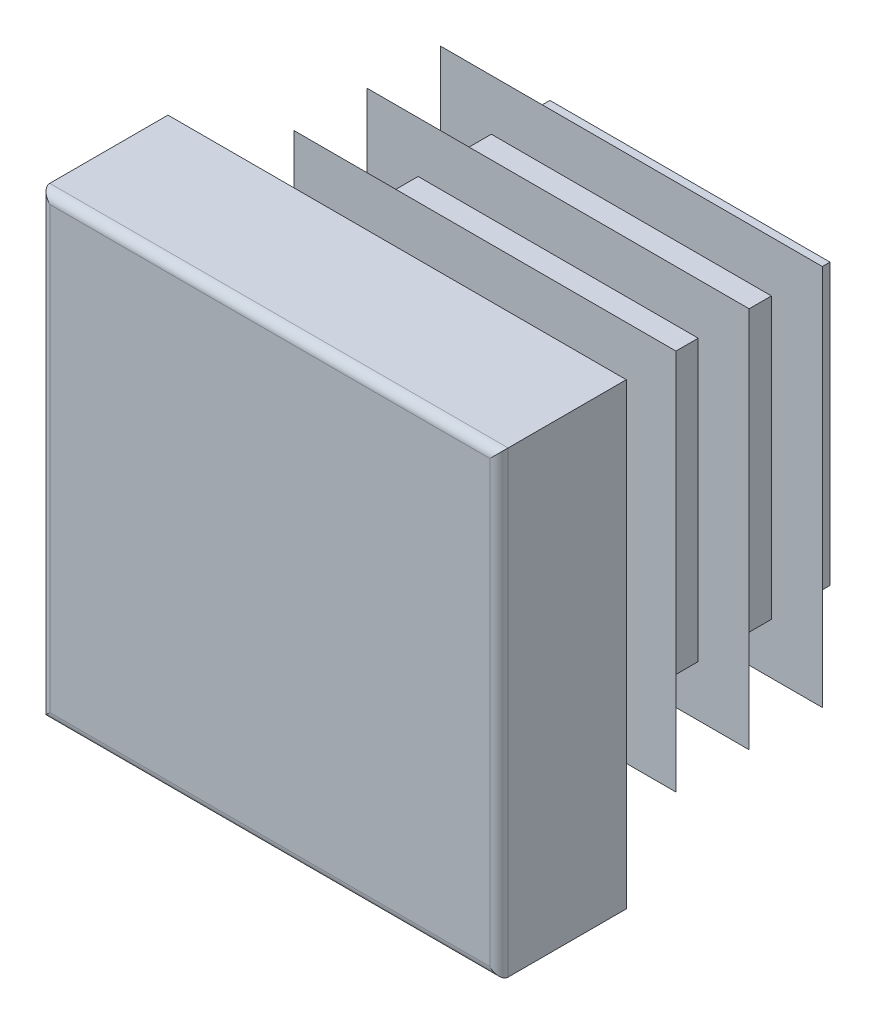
ISO-10303-21;
HEADER;
FILE_DESCRIPTION(('STEP AP214'),'2;1');
FILE_NAME('part.step','',(''),(''),'','','');
FILE_SCHEMA(('AUTOMOTIVE_DESIGN { 1 0 10303 214 1 1 1 1 }'));
ENDSEC;
DATA;
#1=APPLICATION_CONTEXT('core data for automotive mechanical design processes');
#2=APPLICATION_PROTOCOL_DEFINITION('international standard','automotive_design',2000,#1);
#3=PRODUCT_CONTEXT('',#1,'mechanical');
#4=PRODUCT('Part','Part','',(#3));
#5=PRODUCT_RELATED_PRODUCT_CATEGORY('part','',(#4));
#6=PRODUCT_DEFINITION_FORMATION('','',#4);
#7=PRODUCT_DEFINITION_CONTEXT('part definition',#1,'design');
#8=PRODUCT_DEFINITION('design','',#6,#7);
#9=PRODUCT_DEFINITION_SHAPE('','',#8);
#10=(LENGTH_UNIT() NAMED_UNIT(*) SI_UNIT(.MILLI.,.METRE.));
#11=(NAMED_UNIT(*) PLANE_ANGLE_UNIT() SI_UNIT($,.RADIAN.));
#12=(NAMED_UNIT(*) SI_UNIT($,.STERADIAN.) SOLID_ANGLE_UNIT());
#13=UNCERTAINTY_MEASURE_WITH_UNIT(LENGTH_MEASURE(1.E-05),#10,'distance_accuracy_value','');
#14=(GEOMETRIC_REPRESENTATION_CONTEXT(3) GLOBAL_UNCERTAINTY_ASSIGNED_CONTEXT((#13)) GLOBAL_UNIT_ASSIGNED_CONTEXT((#10,
#11,#12)) REPRESENTATION_CONTEXT('',''));
#15=CARTESIAN_POINT('',(0.,0.,0.));
#16=DIRECTION('',(0.,0.,1.));
#17=DIRECTION('',(1.,0.,0.));
#18=AXIS2_PLACEMENT_3D('',#15,#16,#17);
#19=CARTESIAN_POINT('',(8.64,-9.,5.));
#20=DIRECTION('',(0.,0.,-1.));
#21=DIRECTION('',(0.,1.,0.));
#22=AXIS2_PLACEMENT_3D('',#19,#20,#21);
#23=PLANE('',#22);
#24=DIRECTION('',(0.,1.,0.));
#25=VECTOR('',#24,1.);
#26=CARTESIAN_POINT('',(-8.64,-9.,5.));
#27=LINE('',#26,#25);
#28=CARTESIAN_POINT('',(-8.64,-8.64,5.));
#29=VERTEX_POINT('',#28);
#30=CARTESIAN_POINT('',(-8.64,8.64,5.));
#31=VERTEX_POINT('',#30);
#32=EDGE_CURVE('E262',#29,#31,#27,.T.);
#33=ORIENTED_EDGE('',*,*,#32,.F.);
#34=DIRECTION('',(-1.,0.,0.));
#35=VECTOR('',#34,1.);
#36=CARTESIAN_POINT('',(9.,-8.64,5.));
#37=LINE('',#36,#35);
#38=CARTESIAN_POINT('',(8.64,-8.64,5.));
#39=VERTEX_POINT('',#38);
#40=EDGE_CURVE('E432',#39,#29,#37,.T.);
#41=ORIENTED_EDGE('',*,*,#40,.F.);
#42=DIRECTION('',(0.,1.,0.));
#43=VECTOR('',#42,1.);
#44=CARTESIAN_POINT('',(8.64,-9.,5.));
#45=LINE('',#44,#43);
#46=CARTESIAN_POINT('',(8.64,8.64,5.));
#47=VERTEX_POINT('',#46);
#48=EDGE_CURVE('E257',#39,#47,#45,.T.);
#49=ORIENTED_EDGE('',*,*,#48,.T.);
#50=DIRECTION('',(-1.,0.,0.));
#51=VECTOR('',#50,1.);
#52=CARTESIAN_POINT('',(9.,8.64,5.));
#53=LINE('',#52,#51);
#54=EDGE_CURVE('E534',#47,#31,#53,.T.);
#55=ORIENTED_EDGE('',*,*,#54,.T.);
#56=EDGE_LOOP('',(#33,#41,#49,#55));
#57=FACE_BOUND('',#56,.T.);
#58=ADVANCED_FACE('F14',(#57),#23,.F.);
#59=CARTESIAN_POINT('',(-8.64,-9.,4.64));
#60=DIRECTION('',(0.,1.,0.));
#61=DIRECTION('',(-1.,0.,0.));
#62=AXIS2_PLACEMENT_3D('',#59,#60,#61);
#63=CYLINDRICAL_SURFACE('',#62,0.36);
#64=DIRECTION('',(0.,1.,0.));
#65=VECTOR('',#64,1.);
#66=CARTESIAN_POINT('',(-9.,-9.,4.64));
#67=LINE('',#66,#65);
#68=CARTESIAN_POINT('',(-9.,-9.,4.64));
#69=VERTEX_POINT('',#68);
#70=CARTESIAN_POINT('',(-9.,9.,4.64));
#71=VERTEX_POINT('',#70);
#72=EDGE_CURVE('E354',#69,#71,#67,.T.);
#73=ORIENTED_EDGE('',*,*,#72,.F.);
#74=CARTESIAN_POINT('',(-8.64,-8.64,4.64));
#75=DIRECTION('',(-0.707106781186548,0.707106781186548,0.));
#76=DIRECTION('',(0.707106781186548,0.707106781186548,0.));
#77=AXIS2_PLACEMENT_3D('',#74,#75,#76);
#78=ELLIPSE('',#77,0.509116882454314,0.36);
#79=EDGE_CURVE('E59',#69,#29,#78,.T.);
#80=ORIENTED_EDGE('',*,*,#79,.T.);
#81=ORIENTED_EDGE('',*,*,#32,.T.);
#82=CARTESIAN_POINT('',(-8.64,8.64,4.64));
#83=DIRECTION('',(0.707106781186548,0.707106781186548,0.));
#84=DIRECTION('',(-0.707106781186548,0.707106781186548,0.));
#85=AXIS2_PLACEMENT_3D('',#82,#83,#84);
#86=ELLIPSE('',#85,0.509116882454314,0.36);
#87=EDGE_CURVE('E258',#31,#71,#86,.F.);
#88=ORIENTED_EDGE('',*,*,#87,.T.);
#89=EDGE_LOOP('',(#73,#80,#81,#88));
#90=FACE_BOUND('',#89,.T.);
#91=ADVANCED_FACE('F16',(#90),#63,.T.);
#92=CARTESIAN_POINT('',(-9.,-9.,4.64));
#93=DIRECTION('',(1.,0.,0.));
#94=DIRECTION('',(0.,1.,0.));
#95=AXIS2_PLACEMENT_3D('',#92,#93,#94);
#96=PLANE('',#95);
#97=DIRECTION('',(0.,0.,-1.));
#98=VECTOR('',#97,1.);
#99=CARTESIAN_POINT('',(-9.,9.,4.64));
#100=LINE('',#99,#98);
#101=CARTESIAN_POINT('',(-9.,9.,0.));
#102=VERTEX_POINT('',#101);
#103=EDGE_CURVE('E519',#71,#102,#100,.T.);
#104=ORIENTED_EDGE('',*,*,#103,.T.);
#105=DIRECTION('',(0.,1.,0.));
#106=VECTOR('',#105,1.);
#107=CARTESIAN_POINT('',(-9.,-9.,0.));
#108=LINE('',#107,#106);
#109=CARTESIAN_POINT('',(-9.,-9.,0.));
#110=VERTEX_POINT('',#109);
#111=EDGE_CURVE('E352',#110,#102,#108,.T.);
#112=ORIENTED_EDGE('',*,*,#111,.F.);
#113=DIRECTION('',(0.,0.,-1.));
#114=VECTOR('',#113,1.);
#115=CARTESIAN_POINT('',(-9.,-9.,4.64));
#116=LINE('',#115,#114);
#117=EDGE_CURVE('E520',#69,#110,#116,.T.);
#118=ORIENTED_EDGE('',*,*,#117,.F.);
#119=ORIENTED_EDGE('',*,*,#72,.T.);
#120=EDGE_LOOP('',(#104,#112,#118,#119));
#121=FACE_BOUND('',#120,.T.);
#122=ADVANCED_FACE('F604',(#121),#96,.F.);
#123=CARTESIAN_POINT('',(-5.5,-9.,0.));
#124=DIRECTION('',(1.,0.,0.));
#125=DIRECTION('',(0.,1.,0.));
#126=AXIS2_PLACEMENT_3D('',#123,#124,#125);
#127=PLANE('',#126);
#128=DIRECTION('',(0.,1.,0.));
#129=VECTOR('',#128,1.);
#130=CARTESIAN_POINT('',(-5.5,-9.,0.));
#131=LINE('',#130,#129);
#132=CARTESIAN_POINT('',(-5.5,-5.5,0.));
#133=VERTEX_POINT('',#132);
#134=CARTESIAN_POINT('',(-5.5,5.5,0.));
#135=VERTEX_POINT('',#134);
#136=EDGE_CURVE('E349',#133,#135,#131,.T.);
#137=ORIENTED_EDGE('',*,*,#136,.T.);
#138=DIRECTION('',(0.,0.,-1.));
#139=VECTOR('',#138,1.);
#140=CARTESIAN_POINT('',(-5.5,5.5,0.));
#141=LINE('',#140,#139);
#142=CARTESIAN_POINT('',(-5.5,5.5,-0.575));
#143=VERTEX_POINT('',#142);
#144=EDGE_CURVE('E445',#135,#143,#141,.T.);
#145=ORIENTED_EDGE('',*,*,#144,.T.);
#146=DIRECTION('',(0.,1.,0.));
#147=VECTOR('',#146,1.);
#148=CARTESIAN_POINT('',(-5.5,-9.,-0.575));
#149=LINE('',#148,#147);
#150=CARTESIAN_POINT('',(-5.5,-5.5,-0.575));
#151=VERTEX_POINT('',#150);
#152=EDGE_CURVE('E346',#151,#143,#149,.T.);
#153=ORIENTED_EDGE('',*,*,#152,.F.);
#154=DIRECTION('',(0.,0.,1.));
#155=VECTOR('',#154,1.);
#156=CARTESIAN_POINT('',(-5.5,-5.5,0.));
#157=LINE('',#156,#155);
#158=EDGE_CURVE('E439',#151,#133,#157,.T.);
#159=ORIENTED_EDGE('',*,*,#158,.T.);
#160=EDGE_LOOP('',(#137,#145,#153,#159));
#161=FACE_BOUND('',#160,.T.);
#162=ADVANCED_FACE('F728',(#161),#127,.F.);
#163=CARTESIAN_POINT('',(-7.5,-9.,-0.575));
#164=DIRECTION('',(0.573576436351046,0.,0.819152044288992));
#165=DIRECTION('',(-0.819152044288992,0.,0.573576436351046));
#166=AXIS2_PLACEMENT_3D('',#163,#164,#165);
#167=PLANE('',#166);
#168=DIRECTION('',(0.,1.,0.));
#169=VECTOR('',#168,1.);
#170=CARTESIAN_POINT('',(-7.5,-9.,-0.575));
#171=LINE('',#170,#169);
#172=CARTESIAN_POINT('',(-7.5,-7.5,-0.575));
#173=VERTEX_POINT('',#172);
#174=CARTESIAN_POINT('',(-7.5,7.5,-0.575));
#175=VERTEX_POINT('',#174);
#176=EDGE_CURVE('E344',#173,#175,#171,.T.);
#177=ORIENTED_EDGE('',*,*,#176,.T.);
#178=DIRECTION('',(0.633687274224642,-0.633687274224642,-0.443712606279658));
#179=VECTOR('',#178,1.);
#180=CARTESIAN_POINT('',(-0.874267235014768,0.874267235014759,-5.21438802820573));
#181=LINE('',#180,#179);
#182=CARTESIAN_POINT('',(-5.5,5.5,-1.97541507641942));
#183=VERTEX_POINT('',#182);
#184=EDGE_CURVE('E457',#175,#183,#181,.T.);
#185=ORIENTED_EDGE('',*,*,#184,.T.);
#186=DIRECTION('',(0.,1.,0.));
#187=VECTOR('',#186,1.);
#188=CARTESIAN_POINT('',(-5.5,-9.,-1.97541507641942));
#189=LINE('',#188,#187);
#190=CARTESIAN_POINT('',(-5.5,-5.5,-1.97541507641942));
#191=VERTEX_POINT('',#190);
#192=EDGE_CURVE('E341',#191,#183,#189,.T.);
#193=ORIENTED_EDGE('',*,*,#192,.F.);
#194=DIRECTION('',(-0.633687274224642,-0.633687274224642,0.443712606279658));
#195=VECTOR('',#194,1.);
#196=CARTESIAN_POINT('',(-8.10233934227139,-8.10233934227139,-0.153237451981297));
#197=LINE('',#196,#195);
#198=EDGE_CURVE('E451',#191,#173,#197,.T.);
#199=ORIENTED_EDGE('',*,*,#198,.T.);
#200=EDGE_LOOP('',(#177,#185,#193,#199));
#201=FACE_BOUND('',#200,.T.);
#202=ADVANCED_FACE('F732',(#201),#167,.F.);
#203=CARTESIAN_POINT('',(-5.5,-9.,-1.97541507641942));
#204=DIRECTION('',(1.,0.,0.));
#205=DIRECTION('',(0.,1.,0.));
#206=AXIS2_PLACEMENT_3D('',#203,#204,#205);
#207=PLANE('',#206);
#208=ORIENTED_EDGE('',*,*,#192,.T.);
#209=DIRECTION('',(0.,0.,-1.));
#210=VECTOR('',#209,1.);
#211=CARTESIAN_POINT('',(-5.5,5.5,-1.97541507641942));
#212=LINE('',#211,#210);
#213=CARTESIAN_POINT('',(-5.5,5.5,-3.45));
#214=VERTEX_POINT('',#213);
#215=EDGE_CURVE('E463',#183,#214,#212,.T.);
#216=ORIENTED_EDGE('',*,*,#215,.T.);
#217=DIRECTION('',(0.,1.,0.));
#218=VECTOR('',#217,1.);
#219=CARTESIAN_POINT('',(-5.5,-9.,-3.45));
#220=LINE('',#219,#218);
#221=CARTESIAN_POINT('',(-5.5,-5.5,-3.45));
#222=VERTEX_POINT('',#221);
#223=EDGE_CURVE('E338',#222,#214,#220,.T.);
#224=ORIENTED_EDGE('',*,*,#223,.F.);
#225=DIRECTION('',(0.,0.,1.));
#226=VECTOR('',#225,1.);
#227=CARTESIAN_POINT('',(-5.5,-5.5,-1.97541507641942));
#228=LINE('',#227,#226);
#229=EDGE_CURVE('E460',#222,#191,#228,.T.);
#230=ORIENTED_EDGE('',*,*,#229,.T.);
#231=EDGE_LOOP('',(#208,#216,#224,#230));
#232=FACE_BOUND('',#231,.T.);
#233=ADVANCED_FACE('F738',(#232),#207,.F.);
#234=CARTESIAN_POINT('',(-7.5,-9.,-3.45));
#235=DIRECTION('',(0.573576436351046,0.,0.819152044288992));
#236=DIRECTION('',(-0.819152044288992,0.,0.573576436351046));
#237=AXIS2_PLACEMENT_3D('',#234,#235,#236);
#238=PLANE('',#237);
#239=DIRECTION('',(0.,1.,0.));
#240=VECTOR('',#239,1.);
#241=CARTESIAN_POINT('',(-7.5,-9.,-3.45));
#242=LINE('',#241,#240);
#243=CARTESIAN_POINT('',(-7.5,-7.5,-3.45));
#244=VERTEX_POINT('',#243);
#245=CARTESIAN_POINT('',(-7.5,7.5,-3.45));
#246=VERTEX_POINT('',#245);
#247=EDGE_CURVE('E336',#244,#246,#242,.T.);
#248=ORIENTED_EDGE('',*,*,#247,.T.);
#249=DIRECTION('',(0.633687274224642,-0.633687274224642,-0.443712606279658));
#250=VECTOR('',#249,1.);
#251=CARTESIAN_POINT('',(-0.874267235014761,0.874267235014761,-8.08938802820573));
#252=LINE('',#251,#250);
#253=CARTESIAN_POINT('',(-5.5,5.5,-4.85041507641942));
#254=VERTEX_POINT('',#253);
#255=EDGE_CURVE('E475',#246,#254,#252,.T.);
#256=ORIENTED_EDGE('',*,*,#255,.T.);
#257=DIRECTION('',(0.,1.,0.));
#258=VECTOR('',#257,1.);
#259=CARTESIAN_POINT('',(-5.5,-9.,-4.85041507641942));
#260=LINE('',#259,#258);
#261=CARTESIAN_POINT('',(-5.5,-5.5,-4.85041507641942));
#262=VERTEX_POINT('',#261);
#263=EDGE_CURVE('E333',#262,#254,#260,.T.);
#264=ORIENTED_EDGE('',*,*,#263,.F.);
#265=DIRECTION('',(-0.633687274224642,-0.633687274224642,0.443712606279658));
#266=VECTOR('',#265,1.);
#267=CARTESIAN_POINT('',(-8.10233934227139,-8.10233934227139,-3.02823745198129));
#268=LINE('',#267,#266);
#269=EDGE_CURVE('E469',#262,#244,#268,.T.);
#270=ORIENTED_EDGE('',*,*,#269,.T.);
#271=EDGE_LOOP('',(#248,#256,#264,#270));
#272=FACE_BOUND('',#271,.T.);
#273=ADVANCED_FACE('F742',(#272),#238,.F.);
#274=CARTESIAN_POINT('',(-5.5,-9.,-4.85041507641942));
#275=DIRECTION('',(1.,0.,0.));
#276=DIRECTION('',(0.,1.,0.));
#277=AXIS2_PLACEMENT_3D('',#274,#275,#276);
#278=PLANE('',#277);
#279=ORIENTED_EDGE('',*,*,#263,.T.);
#280=DIRECTION('',(0.,0.,-1.));
#281=VECTOR('',#280,1.);
#282=CARTESIAN_POINT('',(-5.5,5.5,-4.85041507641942));
#283=LINE('',#282,#281);
#284=CARTESIAN_POINT('',(-5.5,5.5,-6.325));
#285=VERTEX_POINT('',#284);
#286=EDGE_CURVE('E481',#254,#285,#283,.T.);
#287=ORIENTED_EDGE('',*,*,#286,.T.);
#288=DIRECTION('',(0.,1.,0.));
#289=VECTOR('',#288,1.);
#290=CARTESIAN_POINT('',(-5.5,-9.,-6.325));
#291=LINE('',#290,#289);
#292=CARTESIAN_POINT('',(-5.5,-5.5,-6.325));
#293=VERTEX_POINT('',#292);
#294=EDGE_CURVE('E330',#293,#285,#291,.T.);
#295=ORIENTED_EDGE('',*,*,#294,.F.);
#296=DIRECTION('',(0.,0.,1.));
#297=VECTOR('',#296,1.);
#298=CARTESIAN_POINT('',(-5.5,-5.5,-4.85041507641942));
#299=LINE('',#298,#297);
#300=EDGE_CURVE('E478',#293,#262,#299,.T.);
#301=ORIENTED_EDGE('',*,*,#300,.T.);
#302=EDGE_LOOP('',(#279,#287,#295,#301));
#303=FACE_BOUND('',#302,.T.);
#304=ADVANCED_FACE('F746',(#303),#278,.F.);
#305=CARTESIAN_POINT('',(-7.5,-9.,-6.325));
#306=DIRECTION('',(0.573576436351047,0.,0.819152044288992));
#307=DIRECTION('',(-0.819152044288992,0.,0.573576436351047));
#308=AXIS2_PLACEMENT_3D('',#305,#306,#307);
#309=PLANE('',#308);
#310=DIRECTION('',(0.,1.,0.));
#311=VECTOR('',#310,1.);
#312=CARTESIAN_POINT('',(-7.5,-9.,-6.325));
#313=LINE('',#312,#311);
#314=CARTESIAN_POINT('',(-7.5,-7.5,-6.325));
#315=VERTEX_POINT('',#314);
#316=CARTESIAN_POINT('',(-7.5,7.5,-6.325));
#317=VERTEX_POINT('',#316);
#318=EDGE_CURVE('E328',#315,#317,#313,.T.);
#319=ORIENTED_EDGE('',*,*,#318,.T.);
#320=DIRECTION('',(0.633687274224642,-0.633687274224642,-0.443712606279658));
#321=VECTOR('',#320,1.);
#322=CARTESIAN_POINT('',(-0.874267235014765,0.874267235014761,-10.9643880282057));
#323=LINE('',#322,#321);
#324=CARTESIAN_POINT('',(-5.5,5.5,-7.72541507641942));
#325=VERTEX_POINT('',#324);
#326=EDGE_CURVE('E493',#317,#325,#323,.T.);
#327=ORIENTED_EDGE('',*,*,#326,.T.);
#328=DIRECTION('',(0.,1.,0.));
#329=VECTOR('',#328,1.);
#330=CARTESIAN_POINT('',(-5.5,-9.,-7.72541507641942));
#331=LINE('',#330,#329);
#332=CARTESIAN_POINT('',(-5.5,-5.5,-7.72541507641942));
#333=VERTEX_POINT('',#332);
#334=EDGE_CURVE('E325',#333,#325,#331,.T.);
#335=ORIENTED_EDGE('',*,*,#334,.F.);
#336=DIRECTION('',(-0.633687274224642,-0.633687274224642,0.443712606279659));
#337=VECTOR('',#336,1.);
#338=CARTESIAN_POINT('',(-8.10233934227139,-8.10233934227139,-5.9032374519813));
#339=LINE('',#338,#337);
#340=EDGE_CURVE('E487',#333,#315,#339,.T.);
#341=ORIENTED_EDGE('',*,*,#340,.T.);
#342=EDGE_LOOP('',(#319,#327,#335,#341));
#343=FACE_BOUND('',#342,.T.);
#344=ADVANCED_FACE('F668',(#343),#309,.F.);
#345=CARTESIAN_POINT('',(-5.5,-9.,-7.72541507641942));
#346=DIRECTION('',(1.,0.,0.));
#347=DIRECTION('',(0.,1.,0.));
#348=AXIS2_PLACEMENT_3D('',#345,#346,#347);
#349=PLANE('',#348);
#350=ORIENTED_EDGE('',*,*,#334,.T.);
#351=DIRECTION('',(0.,0.,-1.));
#352=VECTOR('',#351,1.);
#353=CARTESIAN_POINT('',(-5.5,5.5,-7.72541507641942));
#354=LINE('',#353,#352);
#355=CARTESIAN_POINT('',(-5.5,5.5,-9.2));
#356=VERTEX_POINT('',#355);
#357=EDGE_CURVE('E499',#325,#356,#354,.T.);
#358=ORIENTED_EDGE('',*,*,#357,.T.);
#359=DIRECTION('',(0.,1.,0.));
#360=VECTOR('',#359,1.);
#361=CARTESIAN_POINT('',(-5.5,-9.,-9.2));
#362=LINE('',#361,#360);
#363=CARTESIAN_POINT('',(-5.5,-5.5,-9.2));
#364=VERTEX_POINT('',#363);
#365=EDGE_CURVE('E322',#364,#356,#362,.T.);
#366=ORIENTED_EDGE('',*,*,#365,.F.);
#367=DIRECTION('',(0.,0.,1.));
#368=VECTOR('',#367,1.);
#369=CARTESIAN_POINT('',(-5.5,-5.5,-7.72541507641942));
#370=LINE('',#369,#368);
#371=EDGE_CURVE('E496',#364,#333,#370,.T.);
#372=ORIENTED_EDGE('',*,*,#371,.T.);
#373=EDGE_LOOP('',(#350,#358,#366,#372));
#374=FACE_BOUND('',#373,.T.);
#375=ADVANCED_FACE('F665',(#374),#349,.F.);
#376=CARTESIAN_POINT('',(-7.5,-9.,-9.2));
#377=DIRECTION('',(0.573576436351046,0.,0.819152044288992));
#378=DIRECTION('',(-0.819152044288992,0.,0.573576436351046));
#379=AXIS2_PLACEMENT_3D('',#376,#377,#378);
#380=PLANE('',#379);
#381=DIRECTION('',(0.,1.,0.));
#382=VECTOR('',#381,1.);
#383=CARTESIAN_POINT('',(-7.5,-9.,-9.2));
#384=LINE('',#383,#382);
#385=CARTESIAN_POINT('',(-7.5,-7.5,-9.2));
#386=VERTEX_POINT('',#385);
#387=CARTESIAN_POINT('',(-7.5,7.5,-9.2));
#388=VERTEX_POINT('',#387);
#389=EDGE_CURVE('E320',#386,#388,#384,.T.);
#390=ORIENTED_EDGE('',*,*,#389,.T.);
#391=DIRECTION('',(0.633687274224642,-0.633687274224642,-0.443712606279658));
#392=VECTOR('',#391,1.);
#393=CARTESIAN_POINT('',(-0.874267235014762,0.874267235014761,-13.8393880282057));
#394=LINE('',#393,#392);
#395=CARTESIAN_POINT('',(-5.5,5.5,-10.6004150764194));
#396=VERTEX_POINT('',#395);
#397=EDGE_CURVE('E511',#388,#396,#394,.T.);
#398=ORIENTED_EDGE('',*,*,#397,.T.);
#399=DIRECTION('',(0.,1.,0.));
#400=VECTOR('',#399,1.);
#401=CARTESIAN_POINT('',(-5.5,-9.,-10.6004150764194));
#402=LINE('',#401,#400);
#403=CARTESIAN_POINT('',(-5.5,-5.5,-10.6004150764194));
#404=VERTEX_POINT('',#403);
#405=EDGE_CURVE('E317',#404,#396,#402,.T.);
#406=ORIENTED_EDGE('',*,*,#405,.F.);
#407=DIRECTION('',(-0.633687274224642,-0.633687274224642,0.443712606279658));
#408=VECTOR('',#407,1.);
#409=CARTESIAN_POINT('',(-8.10233934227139,-8.10233934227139,-8.7782374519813));
#410=LINE('',#409,#408);
#411=EDGE_CURVE('E505',#404,#386,#410,.T.);
#412=ORIENTED_EDGE('',*,*,#411,.T.);
#413=EDGE_LOOP('',(#390,#398,#406,#412));
#414=FACE_BOUND('',#413,.T.);
#415=ADVANCED_FACE('F580',(#414),#380,.F.);
#416=CARTESIAN_POINT('',(-5.5,-9.,-10.6004150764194));
#417=DIRECTION('',(1.,0.,0.));
#418=DIRECTION('',(0.,0.,1.));
#419=AXIS2_PLACEMENT_3D('',#416,#417,#418);
#420=PLANE('',#419);
#421=ORIENTED_EDGE('',*,*,#405,.T.);
#422=DIRECTION('',(0.,0.,-1.));
#423=VECTOR('',#422,1.);
#424=CARTESIAN_POINT('',(-5.5,5.5,-10.6004150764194));
#425=LINE('',#424,#423);
#426=CARTESIAN_POINT('',(-5.5,5.5,-11.5));
#427=VERTEX_POINT('',#426);
#428=EDGE_CURVE('E517',#396,#427,#425,.T.);
#429=ORIENTED_EDGE('',*,*,#428,.T.);
#430=DIRECTION('',(0.,1.,0.));
#431=VECTOR('',#430,1.);
#432=CARTESIAN_POINT('',(-5.5,-9.,-11.5));
#433=LINE('',#432,#431);
#434=CARTESIAN_POINT('',(-5.5,-5.5,-11.5));
#435=VERTEX_POINT('',#434);
#436=EDGE_CURVE('E314',#435,#427,#433,.T.);
#437=ORIENTED_EDGE('',*,*,#436,.F.);
#438=DIRECTION('',(0.,0.,1.));
#439=VECTOR('',#438,1.);
#440=CARTESIAN_POINT('',(-5.5,-5.5,-10.6004150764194));
#441=LINE('',#440,#439);
#442=EDGE_CURVE('E514',#435,#404,#441,.T.);
#443=ORIENTED_EDGE('',*,*,#442,.T.);
#444=EDGE_LOOP('',(#421,#429,#437,#443));
#445=FACE_BOUND('',#444,.T.);
#446=ADVANCED_FACE('F582',(#445),#420,.F.);
#447=CARTESIAN_POINT('',(-5.5,-9.,-11.5));
#448=DIRECTION('',(0.,0.,1.));
#449=DIRECTION('',(0.,-1.,0.));
#450=AXIS2_PLACEMENT_3D('',#447,#448,#449);
#451=PLANE('',#450);
#452=ORIENTED_EDGE('',*,*,#436,.T.);
#453=DIRECTION('',(-1.,0.,0.));
#454=VECTOR('',#453,1.);
#455=CARTESIAN_POINT('',(9.,5.5,-11.5));
#456=LINE('',#455,#454);
#457=CARTESIAN_POINT('',(5.5,5.5,-11.5));
#458=VERTEX_POINT('',#457);
#459=EDGE_CURVE('E388',#458,#427,#456,.T.);
#460=ORIENTED_EDGE('',*,*,#459,.F.);
#461=DIRECTION('',(0.,1.,0.));
#462=VECTOR('',#461,1.);
#463=CARTESIAN_POINT('',(5.5,-9.,-11.5));
#464=LINE('',#463,#462);
#465=CARTESIAN_POINT('',(5.5,-5.5,-11.5));
#466=VERTEX_POINT('',#465);
#467=EDGE_CURVE('E311',#466,#458,#464,.T.);
#468=ORIENTED_EDGE('',*,*,#467,.F.);
#469=DIRECTION('',(-1.,0.,0.));
#470=VECTOR('',#469,1.);
#471=CARTESIAN_POINT('',(9.,-5.5,-11.5));
#472=LINE('',#471,#470);
#473=EDGE_CURVE('E386',#466,#435,#472,.T.);
#474=ORIENTED_EDGE('',*,*,#473,.T.);
#475=EDGE_LOOP('',(#452,#460,#468,#474));
#476=FACE_BOUND('',#475,.T.);
#477=ADVANCED_FACE('F385',(#476),#451,.F.);
#478=CARTESIAN_POINT('',(5.5,-9.,-11.5));
#479=DIRECTION('',(-1.,0.,0.));
#480=DIRECTION('',(0.,0.,-1.));
#481=AXIS2_PLACEMENT_3D('',#478,#479,#480);
#482=PLANE('',#481);
#483=ORIENTED_EDGE('',*,*,#467,.T.);
#484=DIRECTION('',(0.,0.,1.));
#485=VECTOR('',#484,1.);
#486=CARTESIAN_POINT('',(5.5,5.5,-11.5));
#487=LINE('',#486,#485);
#488=CARTESIAN_POINT('',(5.5,5.5,-10.6004150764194));
#489=VERTEX_POINT('',#488);
#490=EDGE_CURVE('E9',#458,#489,#487,.T.);
#491=ORIENTED_EDGE('',*,*,#490,.T.);
#492=DIRECTION('',(0.,1.,0.));
#493=VECTOR('',#492,1.);
#494=CARTESIAN_POINT('',(5.5,-9.,-10.6004150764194));
#495=LINE('',#494,#493);
#496=CARTESIAN_POINT('',(5.5,-5.5,-10.6004150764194));
#497=VERTEX_POINT('',#496);
#498=EDGE_CURVE('E308',#497,#489,#495,.T.);
#499=ORIENTED_EDGE('',*,*,#498,.F.);
#500=DIRECTION('',(0.,0.,-1.));
#501=VECTOR('',#500,1.);
#502=CARTESIAN_POINT('',(5.5,-5.5,-11.5));
#503=LINE('',#502,#501);
#504=EDGE_CURVE('E23',#497,#466,#503,.T.);
#505=ORIENTED_EDGE('',*,*,#504,.T.);
#506=EDGE_LOOP('',(#483,#491,#499,#505));
#507=FACE_BOUND('',#506,.T.);
#508=ADVANCED_FACE('F378',(#507),#482,.F.);
#509=CARTESIAN_POINT('',(5.5,-9.,-10.6004150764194));
#510=DIRECTION('',(-0.573576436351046,0.,0.819152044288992));
#511=DIRECTION('',(-0.819152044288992,0.,-0.573576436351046));
#512=AXIS2_PLACEMENT_3D('',#509,#510,#511);
#513=PLANE('',#512);
#514=ORIENTED_EDGE('',*,*,#498,.T.);
#515=DIRECTION('',(0.633687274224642,0.633687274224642,0.443712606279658));
#516=VECTOR('',#515,1.);
#517=CARTESIAN_POINT('',(-0.322613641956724,-0.322613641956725,-14.6774530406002));
#518=LINE('',#517,#516);
#519=CARTESIAN_POINT('',(7.5,7.5,-9.2));
#520=VERTEX_POINT('',#519);
#521=EDGE_CURVE('E508',#489,#520,#518,.T.);
#522=ORIENTED_EDGE('',*,*,#521,.T.);
#523=DIRECTION('',(0.,1.,0.));
#524=VECTOR('',#523,1.);
#525=CARTESIAN_POINT('',(7.5,-9.,-9.2));
#526=LINE('',#525,#524);
#527=CARTESIAN_POINT('',(7.5,-7.5,-9.2));
#528=VERTEX_POINT('',#527);
#529=EDGE_CURVE('E305',#528,#520,#526,.T.);
#530=ORIENTED_EDGE('',*,*,#529,.F.);
#531=DIRECTION('',(-0.633687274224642,0.633687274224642,-0.443712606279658));
#532=VECTOR('',#531,1.);
#533=CARTESIAN_POINT('',(6.9054584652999,-6.9054584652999,-9.61630246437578));
#534=LINE('',#533,#532);
#535=EDGE_CURVE('E502',#528,#497,#534,.T.);
#536=ORIENTED_EDGE('',*,*,#535,.T.);
#537=EDGE_LOOP('',(#514,#522,#530,#536));
#538=FACE_BOUND('',#537,.T.);
#539=ADVANCED_FACE('F588',(#538),#513,.F.);
#540=CARTESIAN_POINT('',(7.5,-9.,-9.2));
#541=DIRECTION('',(0.,0.,-1.));
#542=DIRECTION('',(0.,1.,0.));
#543=AXIS2_PLACEMENT_3D('',#540,#541,#542);
#544=PLANE('',#543);
#545=ORIENTED_EDGE('',*,*,#529,.T.);
#546=DIRECTION('',(-1.,0.,0.));
#547=VECTOR('',#546,1.);
#548=CARTESIAN_POINT('',(9.,7.5,-9.2));
#549=LINE('',#548,#547);
#550=EDGE_CURVE('E394',#520,#388,#549,.T.);
#551=ORIENTED_EDGE('',*,*,#550,.T.);
#552=ORIENTED_EDGE('',*,*,#389,.F.);
#553=DIRECTION('',(-1.,0.,0.));
#554=VECTOR('',#553,1.);
#555=CARTESIAN_POINT('',(9.,-7.5,-9.2));
#556=LINE('',#555,#554);
#557=EDGE_CURVE('E401',#528,#386,#556,.T.);
#558=ORIENTED_EDGE('',*,*,#557,.F.);
#559=EDGE_LOOP('',(#545,#551,#552,#558));
#560=FACE_BOUND('',#559,.T.);
#561=ORIENTED_EDGE('',*,*,#365,.T.);
#562=DIRECTION('',(-1.,0.,0.));
#563=VECTOR('',#562,1.);
#564=CARTESIAN_POINT('',(9.,5.5,-9.2));
#565=LINE('',#564,#563);
#566=CARTESIAN_POINT('',(5.5,5.5,-9.2));
#567=VERTEX_POINT('',#566);
#568=EDGE_CURVE('E567',#567,#356,#565,.T.);
#569=ORIENTED_EDGE('',*,*,#568,.F.);
#570=DIRECTION('',(0.,1.,0.));
#571=VECTOR('',#570,1.);
#572=CARTESIAN_POINT('',(5.5,-9.,-9.2));
#573=LINE('',#572,#571);
#574=CARTESIAN_POINT('',(5.5,-5.5,-9.2));
#575=VERTEX_POINT('',#574);
#576=EDGE_CURVE('E302',#575,#567,#573,.T.);
#577=ORIENTED_EDGE('',*,*,#576,.F.);
#578=DIRECTION('',(-1.,0.,0.));
#579=VECTOR('',#578,1.);
#580=CARTESIAN_POINT('',(9.,-5.5,-9.2));
#581=LINE('',#580,#579);
#582=EDGE_CURVE('E403',#575,#364,#581,.T.);
#583=ORIENTED_EDGE('',*,*,#582,.T.);
#584=EDGE_LOOP('',(#561,#569,#577,#583));
#585=FACE_BOUND('',#584,.T.);
#586=ADVANCED_FACE('F571',(#560,#585),#544,.F.);
#587=CARTESIAN_POINT('',(5.5,-9.,-9.2));
#588=DIRECTION('',(-1.,0.,0.));
#589=DIRECTION('',(0.,-1.,0.));
#590=AXIS2_PLACEMENT_3D('',#587,#588,#589);
#591=PLANE('',#590);
#592=ORIENTED_EDGE('',*,*,#576,.T.);
#593=DIRECTION('',(0.,0.,1.));
#594=VECTOR('',#593,1.);
#595=CARTESIAN_POINT('',(5.5,5.5,-9.2));
#596=LINE('',#595,#594);
#597=CARTESIAN_POINT('',(5.5,5.5,-7.72541507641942));
#598=VERTEX_POINT('',#597);
#599=EDGE_CURVE('E372',#567,#598,#596,.T.);
#600=ORIENTED_EDGE('',*,*,#599,.T.);
#601=DIRECTION('',(0.,1.,0.));
#602=VECTOR('',#601,1.);
#603=CARTESIAN_POINT('',(5.5,-9.,-7.72541507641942));
#604=LINE('',#603,#602);
#605=CARTESIAN_POINT('',(5.5,-5.5,-7.72541507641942));
#606=VERTEX_POINT('',#605);
#607=EDGE_CURVE('E299',#606,#598,#604,.T.);
#608=ORIENTED_EDGE('',*,*,#607,.F.);
#609=DIRECTION('',(0.,0.,-1.));
#610=VECTOR('',#609,1.);
#611=CARTESIAN_POINT('',(5.5,-5.5,-9.2));
#612=LINE('',#611,#610);
#613=EDGE_CURVE('E369',#606,#575,#612,.T.);
#614=ORIENTED_EDGE('',*,*,#613,.T.);
#615=EDGE_LOOP('',(#592,#600,#608,#614));
#616=FACE_BOUND('',#615,.T.);
#617=ADVANCED_FACE('F596',(#616),#591,.F.);
#618=CARTESIAN_POINT('',(5.5,-9.,-7.72541507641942));
#619=DIRECTION('',(-0.573576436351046,0.,0.819152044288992));
#620=DIRECTION('',(-0.819152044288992,0.,-0.573576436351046));
#621=AXIS2_PLACEMENT_3D('',#618,#619,#620);
#622=PLANE('',#621);
#623=ORIENTED_EDGE('',*,*,#607,.T.);
#624=DIRECTION('',(0.633687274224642,0.633687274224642,0.443712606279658));
#625=VECTOR('',#624,1.);
#626=CARTESIAN_POINT('',(-0.322613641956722,-0.322613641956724,-11.8024530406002));
#627=LINE('',#626,#625);
#628=CARTESIAN_POINT('',(7.5,7.5,-6.325));
#629=VERTEX_POINT('',#628);
#630=EDGE_CURVE('E490',#598,#629,#627,.T.);
#631=ORIENTED_EDGE('',*,*,#630,.T.);
#632=DIRECTION('',(0.,1.,0.));
#633=VECTOR('',#632,1.);
#634=CARTESIAN_POINT('',(7.5,-9.,-6.325));
#635=LINE('',#634,#633);
#636=CARTESIAN_POINT('',(7.5,-7.5,-6.325));
#637=VERTEX_POINT('',#636);
#638=EDGE_CURVE('E296',#637,#629,#635,.T.);
#639=ORIENTED_EDGE('',*,*,#638,.F.);
#640=DIRECTION('',(-0.633687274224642,0.633687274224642,-0.443712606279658));
#641=VECTOR('',#640,1.);
#642=CARTESIAN_POINT('',(6.9054584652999,-6.9054584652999,-6.74130246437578));
#643=LINE('',#642,#641);
#644=EDGE_CURVE('E484',#637,#606,#643,.T.);
#645=ORIENTED_EDGE('',*,*,#644,.T.);
#646=EDGE_LOOP('',(#623,#631,#639,#645));
#647=FACE_BOUND('',#646,.T.);
#648=ADVANCED_FACE('F648',(#647),#622,.F.);
#649=CARTESIAN_POINT('',(7.5,-9.,-6.325));
#650=DIRECTION('',(0.,0.,-1.));
#651=DIRECTION('',(0.,1.,0.));
#652=AXIS2_PLACEMENT_3D('',#649,#650,#651);
#653=PLANE('',#652);
#654=ORIENTED_EDGE('',*,*,#638,.T.);
#655=DIRECTION('',(-1.,0.,0.));
#656=VECTOR('',#655,1.);
#657=CARTESIAN_POINT('',(9.,7.5,-6.325));
#658=LINE('',#657,#656);
#659=EDGE_CURVE('E561',#629,#317,#658,.T.);
#660=ORIENTED_EDGE('',*,*,#659,.T.);
#661=ORIENTED_EDGE('',*,*,#318,.F.);
#662=DIRECTION('',(-1.,0.,0.));
#663=VECTOR('',#662,1.);
#664=CARTESIAN_POINT('',(9.,-7.5,-6.325));
#665=LINE('',#664,#663);
#666=EDGE_CURVE('E409',#637,#315,#665,.T.);
#667=ORIENTED_EDGE('',*,*,#666,.F.);
#668=EDGE_LOOP('',(#654,#660,#661,#667));
#669=FACE_BOUND('',#668,.T.);
#670=ORIENTED_EDGE('',*,*,#294,.T.);
#671=DIRECTION('',(-1.,0.,0.));
#672=VECTOR('',#671,1.);
#673=CARTESIAN_POINT('',(9.,5.5,-6.325));
#674=LINE('',#673,#672);
#675=CARTESIAN_POINT('',(5.5,5.5,-6.325));
#676=VERTEX_POINT('',#675);
#677=EDGE_CURVE('E559',#676,#285,#674,.T.);
#678=ORIENTED_EDGE('',*,*,#677,.F.);
#679=DIRECTION('',(0.,1.,0.));
#680=VECTOR('',#679,1.);
#681=CARTESIAN_POINT('',(5.5,-9.,-6.325));
#682=LINE('',#681,#680);
#683=CARTESIAN_POINT('',(5.5,-5.5,-6.325));
#684=VERTEX_POINT('',#683);
#685=EDGE_CURVE('E293',#684,#676,#682,.T.);
#686=ORIENTED_EDGE('',*,*,#685,.F.);
#687=DIRECTION('',(-1.,0.,0.));
#688=VECTOR('',#687,1.);
#689=CARTESIAN_POINT('',(9.,-5.5,-6.325));
#690=LINE('',#689,#688);
#691=EDGE_CURVE('E411',#684,#293,#690,.T.);
#692=ORIENTED_EDGE('',*,*,#691,.T.);
#693=EDGE_LOOP('',(#670,#678,#686,#692));
#694=FACE_BOUND('',#693,.T.);
#695=ADVANCED_FACE('F644',(#669,#694),#653,.F.);
#696=CARTESIAN_POINT('',(5.5,-9.,-6.325));
#697=DIRECTION('',(-1.,0.,0.));
#698=DIRECTION('',(0.,-1.,0.));
#699=AXIS2_PLACEMENT_3D('',#696,#697,#698);
#700=PLANE('',#699);
#701=ORIENTED_EDGE('',*,*,#685,.T.);
#702=DIRECTION('',(0.,0.,1.));
#703=VECTOR('',#702,1.);
#704=CARTESIAN_POINT('',(5.5,5.5,-6.325));
#705=LINE('',#704,#703);
#706=CARTESIAN_POINT('',(5.5,5.5,-4.85041507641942));
#707=VERTEX_POINT('',#706);
#708=EDGE_CURVE('E366',#676,#707,#705,.T.);
#709=ORIENTED_EDGE('',*,*,#708,.T.);
#710=DIRECTION('',(0.,1.,0.));
#711=VECTOR('',#710,1.);
#712=CARTESIAN_POINT('',(5.5,-9.,-4.85041507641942));
#713=LINE('',#712,#711);
#714=CARTESIAN_POINT('',(5.5,-5.5,-4.85041507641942));
#715=VERTEX_POINT('',#714);
#716=EDGE_CURVE('E290',#715,#707,#713,.T.);
#717=ORIENTED_EDGE('',*,*,#716,.F.);
#718=DIRECTION('',(0.,0.,-1.));
#719=VECTOR('',#718,1.);
#720=CARTESIAN_POINT('',(5.5,-5.5,-6.325));
#721=LINE('',#720,#719);
#722=EDGE_CURVE('E363',#715,#684,#721,.T.);
#723=ORIENTED_EDGE('',*,*,#722,.T.);
#724=EDGE_LOOP('',(#701,#709,#717,#723));
#725=FACE_BOUND('',#724,.T.);
#726=ADVANCED_FACE('F640',(#725),#700,.F.);
#727=CARTESIAN_POINT('',(5.5,-9.,-4.85041507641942));
#728=DIRECTION('',(-0.573576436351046,0.,0.819152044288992));
#729=DIRECTION('',(-0.819152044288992,0.,-0.573576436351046));
#730=AXIS2_PLACEMENT_3D('',#727,#728,#729);
#731=PLANE('',#730);
#732=ORIENTED_EDGE('',*,*,#716,.T.);
#733=DIRECTION('',(0.633687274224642,0.633687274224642,0.443712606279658));
#734=VECTOR('',#733,1.);
#735=CARTESIAN_POINT('',(-0.322613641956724,-0.322613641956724,-8.92745304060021));
#736=LINE('',#735,#734);
#737=CARTESIAN_POINT('',(7.5,7.5,-3.45));
#738=VERTEX_POINT('',#737);
#739=EDGE_CURVE('E472',#707,#738,#736,.T.);
#740=ORIENTED_EDGE('',*,*,#739,.T.);
#741=DIRECTION('',(0.,1.,0.));
#742=VECTOR('',#741,1.);
#743=CARTESIAN_POINT('',(7.5,-9.,-3.45));
#744=LINE('',#743,#742);
#745=CARTESIAN_POINT('',(7.5,-7.5,-3.45));
#746=VERTEX_POINT('',#745);
#747=EDGE_CURVE('E287',#746,#738,#744,.T.);
#748=ORIENTED_EDGE('',*,*,#747,.F.);
#749=DIRECTION('',(-0.633687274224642,0.633687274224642,-0.443712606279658));
#750=VECTOR('',#749,1.);
#751=CARTESIAN_POINT('',(6.9054584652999,-6.9054584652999,-3.86630246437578));
#752=LINE('',#751,#750);
#753=EDGE_CURVE('E466',#746,#715,#752,.T.);
#754=ORIENTED_EDGE('',*,*,#753,.T.);
#755=EDGE_LOOP('',(#732,#740,#748,#754));
#756=FACE_BOUND('',#755,.T.);
#757=ADVANCED_FACE('F636',(#756),#731,.F.);
#758=CARTESIAN_POINT('',(7.5,-9.,-3.45));
#759=DIRECTION('',(0.,0.,-1.));
#760=DIRECTION('',(0.,1.,0.));
#761=AXIS2_PLACEMENT_3D('',#758,#759,#760);
#762=PLANE('',#761);
#763=ORIENTED_EDGE('',*,*,#747,.T.);
#764=DIRECTION('',(-1.,0.,0.));
#765=VECTOR('',#764,1.);
#766=CARTESIAN_POINT('',(9.,7.5,-3.45));
#767=LINE('',#766,#765);
#768=EDGE_CURVE('E553',#738,#246,#767,.T.);
#769=ORIENTED_EDGE('',*,*,#768,.T.);
#770=ORIENTED_EDGE('',*,*,#247,.F.);
#771=DIRECTION('',(-1.,0.,0.));
#772=VECTOR('',#771,1.);
#773=CARTESIAN_POINT('',(9.,-7.5,-3.45));
#774=LINE('',#773,#772);
#775=EDGE_CURVE('E417',#746,#244,#774,.T.);
#776=ORIENTED_EDGE('',*,*,#775,.F.);
#777=EDGE_LOOP('',(#763,#769,#770,#776));
#778=FACE_BOUND('',#777,.T.);
#779=ORIENTED_EDGE('',*,*,#223,.T.);
#780=DIRECTION('',(-1.,0.,0.));
#781=VECTOR('',#780,1.);
#782=CARTESIAN_POINT('',(9.,5.5,-3.45));
#783=LINE('',#782,#781);
#784=CARTESIAN_POINT('',(5.5,5.5,-3.45));
#785=VERTEX_POINT('',#784);
#786=EDGE_CURVE('E551',#785,#214,#783,.T.);
#787=ORIENTED_EDGE('',*,*,#786,.F.);
#788=DIRECTION('',(0.,1.,0.));
#789=VECTOR('',#788,1.);
#790=CARTESIAN_POINT('',(5.5,-9.,-3.45));
#791=LINE('',#790,#789);
#792=CARTESIAN_POINT('',(5.5,-5.5,-3.45));
#793=VERTEX_POINT('',#792);
#794=EDGE_CURVE('E284',#793,#785,#791,.T.);
#795=ORIENTED_EDGE('',*,*,#794,.F.);
#796=DIRECTION('',(-1.,0.,0.));
#797=VECTOR('',#796,1.);
#798=CARTESIAN_POINT('',(9.,-5.5,-3.45));
#799=LINE('',#798,#797);
#800=EDGE_CURVE('E419',#793,#222,#799,.T.);
#801=ORIENTED_EDGE('',*,*,#800,.T.);
#802=EDGE_LOOP('',(#779,#787,#795,#801));
#803=FACE_BOUND('',#802,.T.);
#804=ADVANCED_FACE('F632',(#778,#803),#762,.F.);
#805=CARTESIAN_POINT('',(5.5,-9.,-3.45));
#806=DIRECTION('',(-1.,0.,0.));
#807=DIRECTION('',(0.,-1.,0.));
#808=AXIS2_PLACEMENT_3D('',#805,#806,#807);
#809=PLANE('',#808);
#810=ORIENTED_EDGE('',*,*,#794,.T.);
#811=DIRECTION('',(0.,0.,1.));
#812=VECTOR('',#811,1.);
#813=CARTESIAN_POINT('',(5.5,5.5,-3.45));
#814=LINE('',#813,#812);
#815=CARTESIAN_POINT('',(5.5,5.5,-1.97541507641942));
#816=VERTEX_POINT('',#815);
#817=EDGE_CURVE('E360',#785,#816,#814,.T.);
#818=ORIENTED_EDGE('',*,*,#817,.T.);
#819=DIRECTION('',(0.,1.,0.));
#820=VECTOR('',#819,1.);
#821=CARTESIAN_POINT('',(5.5,-9.,-1.97541507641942));
#822=LINE('',#821,#820);
#823=CARTESIAN_POINT('',(5.5,-5.5,-1.97541507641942));
#824=VERTEX_POINT('',#823);
#825=EDGE_CURVE('E281',#824,#816,#822,.T.);
#826=ORIENTED_EDGE('',*,*,#825,.F.);
#827=DIRECTION('',(0.,0.,-1.));
#828=VECTOR('',#827,1.);
#829=CARTESIAN_POINT('',(5.5,-5.5,-3.45));
#830=LINE('',#829,#828);
#831=EDGE_CURVE('E357',#824,#793,#830,.T.);
#832=ORIENTED_EDGE('',*,*,#831,.T.);
#833=EDGE_LOOP('',(#810,#818,#826,#832));
#834=FACE_BOUND('',#833,.T.);
#835=ADVANCED_FACE('F628',(#834),#809,.F.);
#836=CARTESIAN_POINT('',(5.5,-9.,-1.97541507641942));
#837=DIRECTION('',(-0.573576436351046,0.,0.819152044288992));
#838=DIRECTION('',(-0.819152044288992,0.,-0.573576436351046));
#839=AXIS2_PLACEMENT_3D('',#836,#837,#838);
#840=PLANE('',#839);
#841=ORIENTED_EDGE('',*,*,#825,.T.);
#842=DIRECTION('',(0.633687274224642,0.633687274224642,0.443712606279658));
#843=VECTOR('',#842,1.);
#844=CARTESIAN_POINT('',(-0.322613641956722,-0.322613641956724,-6.05245304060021));
#845=LINE('',#844,#843);
#846=CARTESIAN_POINT('',(7.5,7.5,-0.575));
#847=VERTEX_POINT('',#846);
#848=EDGE_CURVE('E454',#816,#847,#845,.T.);
#849=ORIENTED_EDGE('',*,*,#848,.T.);
#850=DIRECTION('',(0.,1.,0.));
#851=VECTOR('',#850,1.);
#852=CARTESIAN_POINT('',(7.5,-9.,-0.575));
#853=LINE('',#852,#851);
#854=CARTESIAN_POINT('',(7.5,-7.5,-0.575));
#855=VERTEX_POINT('',#854);
#856=EDGE_CURVE('E278',#855,#847,#853,.T.);
#857=ORIENTED_EDGE('',*,*,#856,.F.);
#858=DIRECTION('',(-0.633687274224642,0.633687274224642,-0.443712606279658));
#859=VECTOR('',#858,1.);
#860=CARTESIAN_POINT('',(6.9054584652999,-6.9054584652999,-0.991302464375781));
#861=LINE('',#860,#859);
#862=EDGE_CURVE('E448',#855,#824,#861,.T.);
#863=ORIENTED_EDGE('',*,*,#862,.T.);
#864=EDGE_LOOP('',(#841,#849,#857,#863));
#865=FACE_BOUND('',#864,.T.);
#866=ADVANCED_FACE('F624',(#865),#840,.F.);
#867=CARTESIAN_POINT('',(7.5,-9.,-0.575));
#868=DIRECTION('',(0.,0.,-1.));
#869=DIRECTION('',(1.,0.,0.));
#870=AXIS2_PLACEMENT_3D('',#867,#868,#869);
#871=PLANE('',#870);
#872=ORIENTED_EDGE('',*,*,#856,.T.);
#873=DIRECTION('',(-1.,0.,0.));
#874=VECTOR('',#873,1.);
#875=CARTESIAN_POINT('',(9.,7.5,-0.575));
#876=LINE('',#875,#874);
#877=EDGE_CURVE('E545',#847,#175,#876,.T.);
#878=ORIENTED_EDGE('',*,*,#877,.T.);
#879=ORIENTED_EDGE('',*,*,#176,.F.);
#880=DIRECTION('',(-1.,0.,0.));
#881=VECTOR('',#880,1.);
#882=CARTESIAN_POINT('',(9.,-7.5,-0.575));
#883=LINE('',#882,#881);
#884=EDGE_CURVE('E425',#855,#173,#883,.T.);
#885=ORIENTED_EDGE('',*,*,#884,.F.);
#886=EDGE_LOOP('',(#872,#878,#879,#885));
#887=FACE_BOUND('',#886,.T.);
#888=ORIENTED_EDGE('',*,*,#152,.T.);
#889=DIRECTION('',(-1.,0.,0.));
#890=VECTOR('',#889,1.);
#891=CARTESIAN_POINT('',(9.,5.5,-0.575));
#892=LINE('',#891,#890);
#893=CARTESIAN_POINT('',(5.5,5.5,-0.575));
#894=VERTEX_POINT('',#893);
#895=EDGE_CURVE('E543',#894,#143,#892,.T.);
#896=ORIENTED_EDGE('',*,*,#895,.F.);
#897=DIRECTION('',(0.,1.,0.));
#898=VECTOR('',#897,1.);
#899=CARTESIAN_POINT('',(5.5,-9.,-0.575));
#900=LINE('',#899,#898);
#901=CARTESIAN_POINT('',(5.5,-5.5,-0.575));
#902=VERTEX_POINT('',#901);
#903=EDGE_CURVE('E275',#902,#894,#900,.T.);
#904=ORIENTED_EDGE('',*,*,#903,.F.);
#905=DIRECTION('',(-1.,0.,0.));
#906=VECTOR('',#905,1.);
#907=CARTESIAN_POINT('',(9.,-5.5,-0.575));
#908=LINE('',#907,#906);
#909=EDGE_CURVE('E427',#902,#151,#908,.T.);
#910=ORIENTED_EDGE('',*,*,#909,.T.);
#911=EDGE_LOOP('',(#888,#896,#904,#910));
#912=FACE_BOUND('',#911,.T.);
#913=ADVANCED_FACE('F620',(#887,#912),#871,.F.);
#914=CARTESIAN_POINT('',(5.5,-9.,-0.575));
#915=DIRECTION('',(-1.,0.,0.));
#916=DIRECTION('',(0.,-1.,0.));
#917=AXIS2_PLACEMENT_3D('',#914,#915,#916);
#918=PLANE('',#917);
#919=ORIENTED_EDGE('',*,*,#903,.T.);
#920=DIRECTION('',(0.,0.,1.));
#921=VECTOR('',#920,1.);
#922=CARTESIAN_POINT('',(5.5,5.5,-0.575));
#923=LINE('',#922,#921);
#924=CARTESIAN_POINT('',(5.5,5.5,0.));
#925=VERTEX_POINT('',#924);
#926=EDGE_CURVE('E442',#894,#925,#923,.T.);
#927=ORIENTED_EDGE('',*,*,#926,.T.);
#928=DIRECTION('',(0.,1.,0.));
#929=VECTOR('',#928,1.);
#930=CARTESIAN_POINT('',(5.5,-9.,0.));
#931=LINE('',#930,#929);
#932=CARTESIAN_POINT('',(5.5,-5.5,0.));
#933=VERTEX_POINT('',#932);
#934=EDGE_CURVE('E268',#933,#925,#931,.T.);
#935=ORIENTED_EDGE('',*,*,#934,.F.);
#936=DIRECTION('',(0.,0.,-1.));
#937=VECTOR('',#936,1.);
#938=CARTESIAN_POINT('',(5.5,-5.5,-0.575));
#939=LINE('',#938,#937);
#940=EDGE_CURVE('E436',#933,#902,#939,.T.);
#941=ORIENTED_EDGE('',*,*,#940,.T.);
#942=EDGE_LOOP('',(#919,#927,#935,#941));
#943=FACE_BOUND('',#942,.T.);
#944=ADVANCED_FACE('F616',(#943),#918,.F.);
#945=CARTESIAN_POINT('',(5.5,-9.,0.));
#946=DIRECTION('',(0.,0.,1.));
#947=DIRECTION('',(-1.,0.,0.));
#948=AXIS2_PLACEMENT_3D('',#945,#946,#947);
#949=PLANE('',#948);
#950=DIRECTION('',(-1.,0.,0.));
#951=VECTOR('',#950,1.);
#952=CARTESIAN_POINT('',(9.,5.5,0.));
#953=LINE('',#952,#951);
#954=EDGE_CURVE('E538',#925,#135,#953,.T.);
#955=ORIENTED_EDGE('',*,*,#954,.T.);
#956=ORIENTED_EDGE('',*,*,#136,.F.);
#957=DIRECTION('',(-1.,0.,0.));
#958=VECTOR('',#957,1.);
#959=CARTESIAN_POINT('',(9.,-5.5,0.));
#960=LINE('',#959,#958);
#961=EDGE_CURVE('E248',#933,#133,#960,.T.);
#962=ORIENTED_EDGE('',*,*,#961,.F.);
#963=ORIENTED_EDGE('',*,*,#934,.T.);
#964=EDGE_LOOP('',(#955,#956,#962,#963));
#965=FACE_BOUND('',#964,.T.);
#966=ORIENTED_EDGE('',*,*,#111,.T.);
#967=DIRECTION('',(1.,0.,0.));
#968=VECTOR('',#967,1.);
#969=CARTESIAN_POINT('',(5.5,9.,0.));
#970=LINE('',#969,#968);
#971=CARTESIAN_POINT('',(9.,9.,0.));
#972=VERTEX_POINT('',#971);
#973=EDGE_CURVE('E525',#102,#972,#970,.T.);
#974=ORIENTED_EDGE('',*,*,#973,.T.);
#975=DIRECTION('',(0.,1.,0.));
#976=VECTOR('',#975,1.);
#977=CARTESIAN_POINT('',(9.,-9.,0.));
#978=LINE('',#977,#976);
#979=CARTESIAN_POINT('',(9.,-9.,0.));
#980=VERTEX_POINT('',#979);
#981=EDGE_CURVE('E45',#980,#972,#978,.T.);
#982=ORIENTED_EDGE('',*,*,#981,.F.);
#983=DIRECTION('',(1.,0.,0.));
#984=VECTOR('',#983,1.);
#985=CARTESIAN_POINT('',(-9.,-9.,0.));
#986=LINE('',#985,#984);
#987=EDGE_CURVE('E31',#110,#980,#986,.T.);
#988=ORIENTED_EDGE('',*,*,#987,.F.);
#989=EDGE_LOOP('',(#966,#974,#982,#988));
#990=FACE_BOUND('',#989,.T.);
#991=ADVANCED_FACE('F613',(#965,#990),#949,.F.);
#992=CARTESIAN_POINT('',(9.,-9.,0.));
#993=DIRECTION('',(-1.,0.,0.));
#994=DIRECTION('',(0.,-1.,0.));
#995=AXIS2_PLACEMENT_3D('',#992,#993,#994);
#996=PLANE('',#995);
#997=DIRECTION('',(0.,0.,1.));
#998=VECTOR('',#997,1.);
#999=CARTESIAN_POINT('',(9.,9.,0.));
#1000=LINE('',#999,#998);
#1001=CARTESIAN_POINT('',(9.,9.,4.64));
#1002=VERTEX_POINT('',#1001);
#1003=EDGE_CURVE('E266',#972,#1002,#1000,.T.);
#1004=ORIENTED_EDGE('',*,*,#1003,.T.);
#1005=DIRECTION('',(0.,1.,0.));
#1006=VECTOR('',#1005,1.);
#1007=CARTESIAN_POINT('',(9.,-9.,4.64));
#1008=LINE('',#1007,#1006);
#1009=CARTESIAN_POINT('',(9.,-9.,4.64));
#1010=VERTEX_POINT('',#1009);
#1011=EDGE_CURVE('E255',#1010,#1002,#1008,.T.);
#1012=ORIENTED_EDGE('',*,*,#1011,.F.);
#1013=DIRECTION('',(0.,0.,1.));
#1014=VECTOR('',#1013,1.);
#1015=CARTESIAN_POINT('',(9.,-9.,0.));
#1016=LINE('',#1015,#1014);
#1017=EDGE_CURVE('E260',#980,#1010,#1016,.T.);
#1018=ORIENTED_EDGE('',*,*,#1017,.F.);
#1019=ORIENTED_EDGE('',*,*,#981,.T.);
#1020=EDGE_LOOP('',(#1004,#1012,#1018,#1019));
#1021=FACE_BOUND('',#1020,.T.);
#1022=ADVANCED_FACE('F264',(#1021),#996,.F.);
#1023=CARTESIAN_POINT('',(8.64,-9.,4.64));
#1024=DIRECTION('',(0.,1.,0.));
#1025=DIRECTION('',(-1.,0.,0.));
#1026=AXIS2_PLACEMENT_3D('',#1023,#1024,#1025);
#1027=CYLINDRICAL_SURFACE('',#1026,0.36);
#1028=ORIENTED_EDGE('',*,*,#48,.F.);
#1029=CARTESIAN_POINT('',(8.64,-8.64,4.64));
#1030=DIRECTION('',(0.707106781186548,0.707106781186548,0.));
#1031=DIRECTION('',(-0.707106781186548,0.707106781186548,0.));
#1032=AXIS2_PLACEMENT_3D('',#1029,#1030,#1031);
#1033=ELLIPSE('',#1032,0.509116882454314,0.36);
#1034=EDGE_CURVE('E245',#39,#1010,#1033,.T.);
#1035=ORIENTED_EDGE('',*,*,#1034,.T.);
#1036=ORIENTED_EDGE('',*,*,#1011,.T.);
#1037=CARTESIAN_POINT('',(8.64,8.64,4.64));
#1038=DIRECTION('',(-0.707106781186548,0.707106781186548,0.));
#1039=DIRECTION('',(0.707106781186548,0.707106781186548,0.));
#1040=AXIS2_PLACEMENT_3D('',#1037,#1038,#1039);
#1041=ELLIPSE('',#1040,0.509116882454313,0.36);
#1042=EDGE_CURVE('E52',#1002,#47,#1041,.F.);
#1043=ORIENTED_EDGE('',*,*,#1042,.T.);
#1044=EDGE_LOOP('',(#1028,#1035,#1036,#1043));
#1045=FACE_BOUND('',#1044,.T.);
#1046=ADVANCED_FACE('F253',(#1045),#1027,.T.);
#1047=CARTESIAN_POINT('',(-8.64,-9.,4.64));
#1048=DIRECTION('',(0.,-1.,0.));
#1049=DIRECTION('',(1.,0.,0.));
#1050=AXIS2_PLACEMENT_3D('',#1047,#1048,#1049);
#1051=PLANE('',#1050);
#1052=DIRECTION('',(-1.,0.,0.));
#1053=VECTOR('',#1052,1.);
#1054=CARTESIAN_POINT('',(9.,-9.,4.64));
#1055=LINE('',#1054,#1053);
#1056=EDGE_CURVE('E242',#1010,#69,#1055,.T.);
#1057=ORIENTED_EDGE('',*,*,#1056,.T.);
#1058=ORIENTED_EDGE('',*,*,#117,.T.);
#1059=ORIENTED_EDGE('',*,*,#987,.T.);
#1060=ORIENTED_EDGE('',*,*,#1017,.T.);
#1061=EDGE_LOOP('',(#1057,#1058,#1059,#1060));
#1062=FACE_BOUND('',#1061,.T.);
#1063=ADVANCED_FACE('F261',(#1062),#1051,.T.);
#1064=CARTESIAN_POINT('',(-8.64,9.,4.64));
#1065=DIRECTION('',(0.,-1.,0.));
#1066=DIRECTION('',(1.,0.,0.));
#1067=AXIS2_PLACEMENT_3D('',#1064,#1065,#1066);
#1068=PLANE('',#1067);
#1069=ORIENTED_EDGE('',*,*,#103,.F.);
#1070=DIRECTION('',(-1.,0.,0.));
#1071=VECTOR('',#1070,1.);
#1072=CARTESIAN_POINT('',(9.,9.,4.64));
#1073=LINE('',#1072,#1071);
#1074=EDGE_CURVE('E535',#1002,#71,#1073,.T.);
#1075=ORIENTED_EDGE('',*,*,#1074,.F.);
#1076=ORIENTED_EDGE('',*,*,#1003,.F.);
#1077=ORIENTED_EDGE('',*,*,#973,.F.);
#1078=EDGE_LOOP('',(#1069,#1075,#1076,#1077));
#1079=FACE_BOUND('',#1078,.T.);
#1080=ADVANCED_FACE('F607',(#1079),#1068,.F.);
#1081=CARTESIAN_POINT('',(9.,5.5,-0.575));
#1082=DIRECTION('',(0.,-1.,0.));
#1083=DIRECTION('',(1.,0.,0.));
#1084=AXIS2_PLACEMENT_3D('',#1081,#1082,#1083);
#1085=PLANE('',#1084);
#1086=ORIENTED_EDGE('',*,*,#954,.F.);
#1087=ORIENTED_EDGE('',*,*,#926,.F.);
#1088=ORIENTED_EDGE('',*,*,#895,.T.);
#1089=ORIENTED_EDGE('',*,*,#144,.F.);
#1090=EDGE_LOOP('',(#1086,#1087,#1088,#1089));
#1091=FACE_BOUND('',#1090,.T.);
#1092=ADVANCED_FACE('F715',(#1091),#1085,.F.);
#1093=CARTESIAN_POINT('',(9.,5.5,-1.97541507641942));
#1094=DIRECTION('',(0.,-0.573576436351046,0.819152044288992));
#1095=DIRECTION('',(0.,-0.819152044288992,-0.573576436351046));
#1096=AXIS2_PLACEMENT_3D('',#1093,#1094,#1095);
#1097=PLANE('',#1096);
#1098=ORIENTED_EDGE('',*,*,#877,.F.);
#1099=ORIENTED_EDGE('',*,*,#848,.F.);
#1100=DIRECTION('',(-1.,0.,0.));
#1101=VECTOR('',#1100,1.);
#1102=CARTESIAN_POINT('',(9.,5.5,-1.97541507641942));
#1103=LINE('',#1102,#1101);
#1104=EDGE_CURVE('E548',#816,#183,#1103,.T.);
#1105=ORIENTED_EDGE('',*,*,#1104,.T.);
#1106=ORIENTED_EDGE('',*,*,#184,.F.);
#1107=EDGE_LOOP('',(#1098,#1099,#1105,#1106));
#1108=FACE_BOUND('',#1107,.T.);
#1109=ADVANCED_FACE('F720',(#1108),#1097,.F.);
#1110=CARTESIAN_POINT('',(9.,5.5,-3.45));
#1111=DIRECTION('',(0.,-1.,0.));
#1112=DIRECTION('',(1.,0.,0.));
#1113=AXIS2_PLACEMENT_3D('',#1110,#1111,#1112);
#1114=PLANE('',#1113);
#1115=ORIENTED_EDGE('',*,*,#1104,.F.);
#1116=ORIENTED_EDGE('',*,*,#817,.F.);
#1117=ORIENTED_EDGE('',*,*,#786,.T.);
#1118=ORIENTED_EDGE('',*,*,#215,.F.);
#1119=EDGE_LOOP('',(#1115,#1116,#1117,#1118));
#1120=FACE_BOUND('',#1119,.T.);
#1121=ADVANCED_FACE('F882',(#1120),#1114,.F.);
#1122=CARTESIAN_POINT('',(9.,5.5,-4.85041507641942));
#1123=DIRECTION('',(0.,-0.573576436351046,0.819152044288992));
#1124=DIRECTION('',(0.,-0.819152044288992,-0.573576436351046));
#1125=AXIS2_PLACEMENT_3D('',#1122,#1123,#1124);
#1126=PLANE('',#1125);
#1127=ORIENTED_EDGE('',*,*,#768,.F.);
#1128=ORIENTED_EDGE('',*,*,#739,.F.);
#1129=DIRECTION('',(-1.,0.,0.));
#1130=VECTOR('',#1129,1.);
#1131=CARTESIAN_POINT('',(9.,5.5,-4.85041507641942));
#1132=LINE('',#1131,#1130);
#1133=EDGE_CURVE('E556',#707,#254,#1132,.T.);
#1134=ORIENTED_EDGE('',*,*,#1133,.T.);
#1135=ORIENTED_EDGE('',*,*,#255,.F.);
#1136=EDGE_LOOP('',(#1127,#1128,#1134,#1135));
#1137=FACE_BOUND('',#1136,.T.);
#1138=ADVANCED_FACE('F892',(#1137),#1126,.F.);
#1139=CARTESIAN_POINT('',(9.,5.5,-6.325));
#1140=DIRECTION('',(0.,-1.,0.));
#1141=DIRECTION('',(1.,0.,0.));
#1142=AXIS2_PLACEMENT_3D('',#1139,#1140,#1141);
#1143=PLANE('',#1142);
#1144=ORIENTED_EDGE('',*,*,#1133,.F.);
#1145=ORIENTED_EDGE('',*,*,#708,.F.);
#1146=ORIENTED_EDGE('',*,*,#677,.T.);
#1147=ORIENTED_EDGE('',*,*,#286,.F.);
#1148=EDGE_LOOP('',(#1144,#1145,#1146,#1147));
#1149=FACE_BOUND('',#1148,.T.);
#1150=ADVANCED_FACE('F902',(#1149),#1143,.F.);
#1151=CARTESIAN_POINT('',(9.,5.5,-7.72541507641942));
#1152=DIRECTION('',(0.,-0.573576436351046,0.819152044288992));
#1153=DIRECTION('',(0.,-0.819152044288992,-0.573576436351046));
#1154=AXIS2_PLACEMENT_3D('',#1151,#1152,#1153);
#1155=PLANE('',#1154);
#1156=ORIENTED_EDGE('',*,*,#659,.F.);
#1157=ORIENTED_EDGE('',*,*,#630,.F.);
#1158=DIRECTION('',(-1.,0.,0.));
#1159=VECTOR('',#1158,1.);
#1160=CARTESIAN_POINT('',(9.,5.5,-7.72541507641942));
#1161=LINE('',#1160,#1159);
#1162=EDGE_CURVE('E564',#598,#325,#1161,.T.);
#1163=ORIENTED_EDGE('',*,*,#1162,.T.);
#1164=ORIENTED_EDGE('',*,*,#326,.F.);
#1165=EDGE_LOOP('',(#1156,#1157,#1163,#1164));
#1166=FACE_BOUND('',#1165,.T.);
#1167=ADVANCED_FACE('F672',(#1166),#1155,.F.);
#1168=CARTESIAN_POINT('',(9.,5.5,-9.2));
#1169=DIRECTION('',(0.,-1.,0.));
#1170=DIRECTION('',(1.,0.,0.));
#1171=AXIS2_PLACEMENT_3D('',#1168,#1169,#1170);
#1172=PLANE('',#1171);
#1173=ORIENTED_EDGE('',*,*,#1162,.F.);
#1174=ORIENTED_EDGE('',*,*,#599,.F.);
#1175=ORIENTED_EDGE('',*,*,#568,.T.);
#1176=ORIENTED_EDGE('',*,*,#357,.F.);
#1177=EDGE_LOOP('',(#1173,#1174,#1175,#1176));
#1178=FACE_BOUND('',#1177,.T.);
#1179=ADVANCED_FACE('F663',(#1178),#1172,.F.);
#1180=CARTESIAN_POINT('',(9.,5.5,-10.6004150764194));
#1181=DIRECTION('',(0.,-0.573576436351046,0.819152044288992));
#1182=DIRECTION('',(0.,-0.819152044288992,-0.573576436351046));
#1183=AXIS2_PLACEMENT_3D('',#1180,#1181,#1182);
#1184=PLANE('',#1183);
#1185=ORIENTED_EDGE('',*,*,#550,.F.);
#1186=ORIENTED_EDGE('',*,*,#521,.F.);
#1187=DIRECTION('',(-1.,0.,0.));
#1188=VECTOR('',#1187,1.);
#1189=CARTESIAN_POINT('',(9.,5.5,-10.6004150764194));
#1190=LINE('',#1189,#1188);
#1191=EDGE_CURVE('E391',#489,#396,#1190,.T.);
#1192=ORIENTED_EDGE('',*,*,#1191,.T.);
#1193=ORIENTED_EDGE('',*,*,#397,.F.);
#1194=EDGE_LOOP('',(#1185,#1186,#1192,#1193));
#1195=FACE_BOUND('',#1194,.T.);
#1196=ADVANCED_FACE('F576',(#1195),#1184,.F.);
#1197=CARTESIAN_POINT('',(9.,5.5,-11.5));
#1198=DIRECTION('',(0.,-1.,0.));
#1199=DIRECTION('',(0.,0.,-1.));
#1200=AXIS2_PLACEMENT_3D('',#1197,#1198,#1199);
#1201=PLANE('',#1200);
#1202=ORIENTED_EDGE('',*,*,#1191,.F.);
#1203=ORIENTED_EDGE('',*,*,#490,.F.);
#1204=ORIENTED_EDGE('',*,*,#459,.T.);
#1205=ORIENTED_EDGE('',*,*,#428,.F.);
#1206=EDGE_LOOP('',(#1202,#1203,#1204,#1205));
#1207=FACE_BOUND('',#1206,.T.);
#1208=ADVANCED_FACE('F937',(#1207),#1201,.F.);
#1209=CARTESIAN_POINT('',(9.,8.64,4.64));
#1210=DIRECTION('',(-1.,0.,0.));
#1211=DIRECTION('',(0.,-1.,0.));
#1212=AXIS2_PLACEMENT_3D('',#1209,#1210,#1211);
#1213=CYLINDRICAL_SURFACE('',#1212,0.36);
#1214=ORIENTED_EDGE('',*,*,#54,.F.);
#1215=ORIENTED_EDGE('',*,*,#1042,.F.);
#1216=ORIENTED_EDGE('',*,*,#1074,.T.);
#1217=ORIENTED_EDGE('',*,*,#87,.F.);
#1218=EDGE_LOOP('',(#1214,#1215,#1216,#1217));
#1219=FACE_BOUND('',#1218,.T.);
#1220=ADVANCED_FACE('F709',(#1219),#1213,.T.);
#1221=CARTESIAN_POINT('',(9.,-5.5,0.));
#1222=DIRECTION('',(0.,1.,0.));
#1223=DIRECTION('',(-1.,0.,0.));
#1224=AXIS2_PLACEMENT_3D('',#1221,#1222,#1223);
#1225=PLANE('',#1224);
#1226=ORIENTED_EDGE('',*,*,#909,.F.);
#1227=ORIENTED_EDGE('',*,*,#940,.F.);
#1228=ORIENTED_EDGE('',*,*,#961,.T.);
#1229=ORIENTED_EDGE('',*,*,#158,.F.);
#1230=EDGE_LOOP('',(#1226,#1227,#1228,#1229));
#1231=FACE_BOUND('',#1230,.T.);
#1232=ADVANCED_FACE('F706',(#1231),#1225,.F.);
#1233=CARTESIAN_POINT('',(9.,-7.5,-0.575));
#1234=DIRECTION('',(0.,0.573576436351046,0.819152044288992));
#1235=DIRECTION('',(0.,-0.819152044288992,0.573576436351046));
#1236=AXIS2_PLACEMENT_3D('',#1233,#1234,#1235);
#1237=PLANE('',#1236);
#1238=DIRECTION('',(-1.,0.,0.));
#1239=VECTOR('',#1238,1.);
#1240=CARTESIAN_POINT('',(9.,-5.5,-1.97541507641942));
#1241=LINE('',#1240,#1239);
#1242=EDGE_CURVE('E422',#824,#191,#1241,.T.);
#1243=ORIENTED_EDGE('',*,*,#1242,.F.);
#1244=ORIENTED_EDGE('',*,*,#862,.F.);
#1245=ORIENTED_EDGE('',*,*,#884,.T.);
#1246=ORIENTED_EDGE('',*,*,#198,.F.);
#1247=EDGE_LOOP('',(#1243,#1244,#1245,#1246));
#1248=FACE_BOUND('',#1247,.T.);
#1249=ADVANCED_FACE('F702',(#1248),#1237,.F.);
#1250=CARTESIAN_POINT('',(9.,-5.5,-1.97541507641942));
#1251=DIRECTION('',(0.,1.,0.));
#1252=DIRECTION('',(-1.,0.,0.));
#1253=AXIS2_PLACEMENT_3D('',#1250,#1251,#1252);
#1254=PLANE('',#1253);
#1255=ORIENTED_EDGE('',*,*,#800,.F.);
#1256=ORIENTED_EDGE('',*,*,#831,.F.);
#1257=ORIENTED_EDGE('',*,*,#1242,.T.);
#1258=ORIENTED_EDGE('',*,*,#229,.F.);
#1259=EDGE_LOOP('',(#1255,#1256,#1257,#1258));
#1260=FACE_BOUND('',#1259,.T.);
#1261=ADVANCED_FACE('F698',(#1260),#1254,.F.);
#1262=CARTESIAN_POINT('',(9.,-7.5,-3.45));
#1263=DIRECTION('',(0.,0.573576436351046,0.819152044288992));
#1264=DIRECTION('',(0.,-0.819152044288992,0.573576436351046));
#1265=AXIS2_PLACEMENT_3D('',#1262,#1263,#1264);
#1266=PLANE('',#1265);
#1267=DIRECTION('',(-1.,0.,0.));
#1268=VECTOR('',#1267,1.);
#1269=CARTESIAN_POINT('',(9.,-5.5,-4.85041507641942));
#1270=LINE('',#1269,#1268);
#1271=EDGE_CURVE('E414',#715,#262,#1270,.T.);
#1272=ORIENTED_EDGE('',*,*,#1271,.F.);
#1273=ORIENTED_EDGE('',*,*,#753,.F.);
#1274=ORIENTED_EDGE('',*,*,#775,.T.);
#1275=ORIENTED_EDGE('',*,*,#269,.F.);
#1276=EDGE_LOOP('',(#1272,#1273,#1274,#1275));
#1277=FACE_BOUND('',#1276,.T.);
#1278=ADVANCED_FACE('F694',(#1277),#1266,.F.);
#1279=CARTESIAN_POINT('',(9.,-5.5,-4.85041507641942));
#1280=DIRECTION('',(0.,1.,0.));
#1281=DIRECTION('',(-1.,0.,0.));
#1282=AXIS2_PLACEMENT_3D('',#1279,#1280,#1281);
#1283=PLANE('',#1282);
#1284=ORIENTED_EDGE('',*,*,#691,.F.);
#1285=ORIENTED_EDGE('',*,*,#722,.F.);
#1286=ORIENTED_EDGE('',*,*,#1271,.T.);
#1287=ORIENTED_EDGE('',*,*,#300,.F.);
#1288=EDGE_LOOP('',(#1284,#1285,#1286,#1287));
#1289=FACE_BOUND('',#1288,.T.);
#1290=ADVANCED_FACE('F688',(#1289),#1283,.F.);
#1291=CARTESIAN_POINT('',(9.,-7.5,-6.325));
#1292=DIRECTION('',(0.,0.573576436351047,0.819152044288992));
#1293=DIRECTION('',(0.,-0.819152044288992,0.573576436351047));
#1294=AXIS2_PLACEMENT_3D('',#1291,#1292,#1293);
#1295=PLANE('',#1294);
#1296=DIRECTION('',(-1.,0.,0.));
#1297=VECTOR('',#1296,1.);
#1298=CARTESIAN_POINT('',(9.,-5.5,-7.72541507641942));
#1299=LINE('',#1298,#1297);
#1300=EDGE_CURVE('E406',#606,#333,#1299,.T.);
#1301=ORIENTED_EDGE('',*,*,#1300,.F.);
#1302=ORIENTED_EDGE('',*,*,#644,.F.);
#1303=ORIENTED_EDGE('',*,*,#666,.T.);
#1304=ORIENTED_EDGE('',*,*,#340,.F.);
#1305=EDGE_LOOP('',(#1301,#1302,#1303,#1304));
#1306=FACE_BOUND('',#1305,.T.);
#1307=ADVANCED_FACE('F678',(#1306),#1295,.F.);
#1308=CARTESIAN_POINT('',(9.,-5.5,-7.72541507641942));
#1309=DIRECTION('',(0.,1.,0.));
#1310=DIRECTION('',(-1.,0.,0.));
#1311=AXIS2_PLACEMENT_3D('',#1308,#1309,#1310);
#1312=PLANE('',#1311);
#1313=ORIENTED_EDGE('',*,*,#582,.F.);
#1314=ORIENTED_EDGE('',*,*,#613,.F.);
#1315=ORIENTED_EDGE('',*,*,#1300,.T.);
#1316=ORIENTED_EDGE('',*,*,#371,.F.);
#1317=EDGE_LOOP('',(#1313,#1314,#1315,#1316));
#1318=FACE_BOUND('',#1317,.T.);
#1319=ADVANCED_FACE('F680',(#1318),#1312,.F.);
#1320=CARTESIAN_POINT('',(9.,-7.5,-9.2));
#1321=DIRECTION('',(0.,0.573576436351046,0.819152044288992));
#1322=DIRECTION('',(0.,-0.819152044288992,0.573576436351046));
#1323=AXIS2_PLACEMENT_3D('',#1320,#1321,#1322);
#1324=PLANE('',#1323);
#1325=DIRECTION('',(-1.,0.,0.));
#1326=VECTOR('',#1325,1.);
#1327=CARTESIAN_POINT('',(9.,-5.5,-10.6004150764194));
#1328=LINE('',#1327,#1326);
#1329=EDGE_CURVE('E396',#497,#404,#1328,.T.);
#1330=ORIENTED_EDGE('',*,*,#1329,.F.);
#1331=ORIENTED_EDGE('',*,*,#535,.F.);
#1332=ORIENTED_EDGE('',*,*,#557,.T.);
#1333=ORIENTED_EDGE('',*,*,#411,.F.);
#1334=EDGE_LOOP('',(#1330,#1331,#1332,#1333));
#1335=FACE_BOUND('',#1334,.T.);
#1336=ADVANCED_FACE('F586',(#1335),#1324,.F.);
#1337=CARTESIAN_POINT('',(9.,-5.5,-10.6004150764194));
#1338=DIRECTION('',(0.,1.,0.));
#1339=DIRECTION('',(0.,0.,1.));
#1340=AXIS2_PLACEMENT_3D('',#1337,#1338,#1339);
#1341=PLANE('',#1340);
#1342=ORIENTED_EDGE('',*,*,#473,.F.);
#1343=ORIENTED_EDGE('',*,*,#504,.F.);
#1344=ORIENTED_EDGE('',*,*,#1329,.T.);
#1345=ORIENTED_EDGE('',*,*,#442,.F.);
#1346=EDGE_LOOP('',(#1342,#1343,#1344,#1345));
#1347=FACE_BOUND('',#1346,.T.);
#1348=ADVANCED_FACE('F583',(#1347),#1341,.F.);
#1349=CARTESIAN_POINT('',(9.,-8.64,4.64));
#1350=DIRECTION('',(-1.,0.,0.));
#1351=DIRECTION('',(0.,-1.,0.));
#1352=AXIS2_PLACEMENT_3D('',#1349,#1350,#1351);
#1353=CYLINDRICAL_SURFACE('',#1352,0.36);
#1354=ORIENTED_EDGE('',*,*,#1056,.F.);
#1355=ORIENTED_EDGE('',*,*,#1034,.F.);
#1356=ORIENTED_EDGE('',*,*,#40,.T.);
#1357=ORIENTED_EDGE('',*,*,#79,.F.);
#1358=EDGE_LOOP('',(#1354,#1355,#1356,#1357));
#1359=FACE_BOUND('',#1358,.T.);
#1360=ADVANCED_FACE('F244',(#1359),#1353,.T.);
#1361=CLOSED_SHELL('',(#58,#91,#122,#162,#202,#233,#273,#304,#344,#375,#415,#446,#477,#508,#539,
#586,#617,#648,#695,#726,#757,#804,#835,#866,#913,#944,#991,#1022,#1046,#1063,#1080,#1092,#1109,
#1121,#1138,#1150,#1167,#1179,#1196,#1208,#1220,#1232,#1249,#1261,#1278,#1290,#1307,#1319,#1336,
#1348,#1360));
#1362=MANIFOLD_SOLID_BREP('B1',#1361);
#1363=ADVANCED_BREP_SHAPE_REPRESENTATION('',(#18,#1362),#14);
#1364=SHAPE_DEFINITION_REPRESENTATION(#9,#1363);
ENDSEC;
END-ISO-10303-21;
